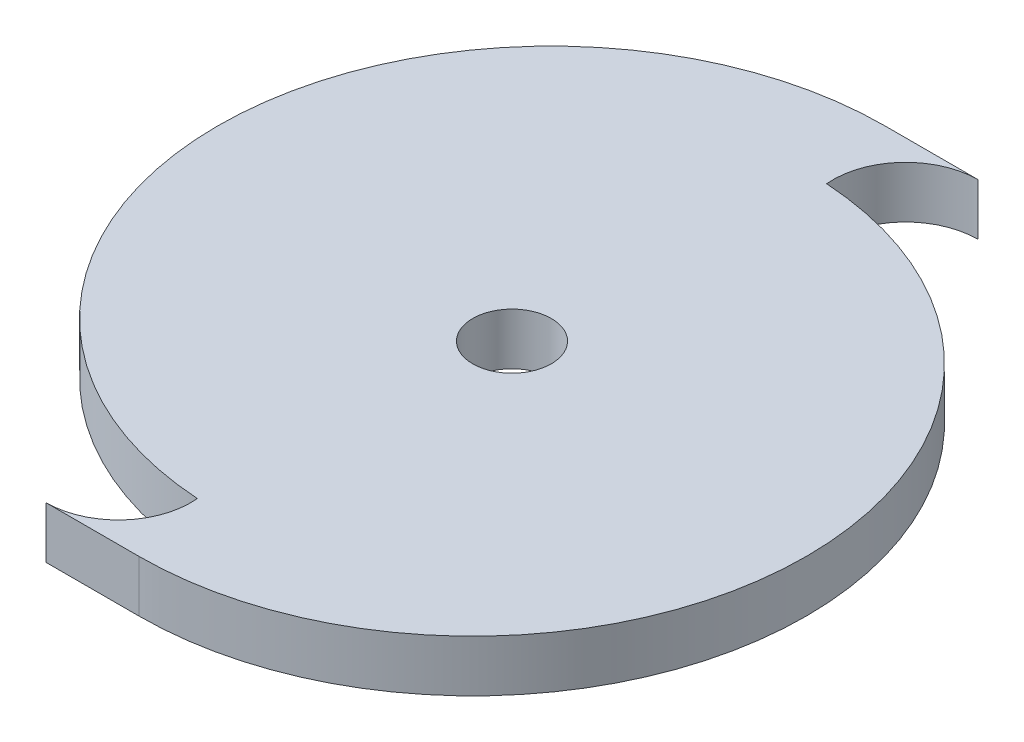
from build123d import *

# Parameters (mm, degrees)
SKETCH1_R           = 7.6
BOSS_EXTRUDE1_DEPTH = 10


with BuildPart() as part:
    # Sketch1 → Boss-Extrude1 (new body)
    with BuildSketch(Plane(origin=(0, 0, 0), x_dir=(1, 0, 0), z_dir=(0, 1, 0))):
        with BuildLine():
            Line((0, 72.1), (18, 72.1))
            ThreePointArc((18, 72.1), (7.641586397, 67.518241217), (4.063137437, 56.771895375))
            ThreePointArc((4.063137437, 56.771895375), (64.467965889, -9.632578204), (0, -72.1))
            Line((0, -72.1), (-18, -72.1))
            ThreePointArc((-18, -72.1), (-7.641586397, -67.518241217), (-4.063137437, -56.771895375))
            ThreePointArc((-4.063137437, -56.771895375), (-64.467965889, 9.632578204), (0, 72.1))
        make_face()
        with Locations(Location((0, 0, 0), (0, 0, 270))):
            Circle(SKETCH1_R, mode=Mode.SUBTRACT)
    extrude(amount=BOSS_EXTRUDE1_DEPTH)


solid = part.part
